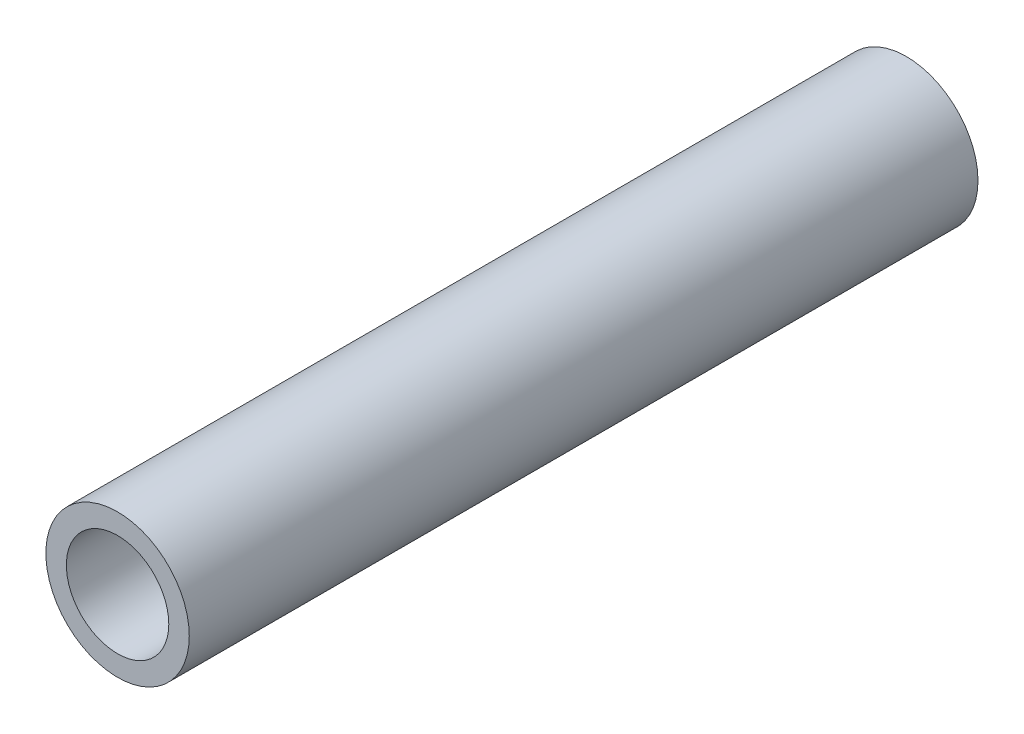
ISO-10303-21;
HEADER;
FILE_DESCRIPTION(('STEP AP214'),'2;1');
FILE_NAME('part.step','',(''),(''),'','','');
FILE_SCHEMA(('AUTOMOTIVE_DESIGN { 1 0 10303 214 1 1 1 1 }'));
ENDSEC;
DATA;
#1=APPLICATION_CONTEXT('core data for automotive mechanical design processes');
#2=APPLICATION_PROTOCOL_DEFINITION('international standard','automotive_design',2000,#1);
#3=PRODUCT_CONTEXT('',#1,'mechanical');
#4=PRODUCT('Part','Part','',(#3));
#5=PRODUCT_RELATED_PRODUCT_CATEGORY('part','',(#4));
#6=PRODUCT_DEFINITION_FORMATION('','',#4);
#7=PRODUCT_DEFINITION_CONTEXT('part definition',#1,'design');
#8=PRODUCT_DEFINITION('design','',#6,#7);
#9=PRODUCT_DEFINITION_SHAPE('','',#8);
#10=(LENGTH_UNIT() NAMED_UNIT(*) SI_UNIT(.MILLI.,.METRE.));
#11=(NAMED_UNIT(*) PLANE_ANGLE_UNIT() SI_UNIT($,.RADIAN.));
#12=(NAMED_UNIT(*) SI_UNIT($,.STERADIAN.) SOLID_ANGLE_UNIT());
#13=UNCERTAINTY_MEASURE_WITH_UNIT(LENGTH_MEASURE(1.E-05),#10,'distance_accuracy_value','');
#14=(GEOMETRIC_REPRESENTATION_CONTEXT(3) GLOBAL_UNCERTAINTY_ASSIGNED_CONTEXT((#13)) GLOBAL_UNIT_ASSIGNED_CONTEXT((#10,
#11,#12)) REPRESENTATION_CONTEXT('',''));
#15=CARTESIAN_POINT('',(0.,0.,0.));
#16=DIRECTION('',(0.,0.,1.));
#17=DIRECTION('',(1.,0.,0.));
#18=AXIS2_PLACEMENT_3D('',#15,#16,#17);
#19=CARTESIAN_POINT('',(0.,0.,154.));
#20=DIRECTION('',(0.,0.,1.));
#21=DIRECTION('',(1.,0.,0.));
#22=AXIS2_PLACEMENT_3D('',#19,#20,#21);
#23=PLANE('',#22);
#24=CARTESIAN_POINT('',(0.,0.,154.));
#25=DIRECTION('',(0.,0.,1.));
#26=DIRECTION('',(1.,0.,0.));
#27=AXIS2_PLACEMENT_3D('',#24,#25,#26);
#28=CIRCLE('',#27,14.);
#29=CARTESIAN_POINT('',(14.,0.,154.));
#30=VERTEX_POINT('',#29);
#31=EDGE_CURVE('E10',#30,#30,#28,.T.);
#32=ORIENTED_EDGE('',*,*,#31,.T.);
#33=EDGE_LOOP('',(#32));
#34=FACE_BOUND('',#33,.T.);
#35=CARTESIAN_POINT('',(0.,0.,154.));
#36=DIRECTION('',(0.,0.,1.));
#37=DIRECTION('',(1.,0.,0.));
#38=AXIS2_PLACEMENT_3D('',#35,#36,#37);
#39=CIRCLE('',#38,10.);
#40=CARTESIAN_POINT('',(10.,0.,154.));
#41=VERTEX_POINT('',#40);
#42=EDGE_CURVE('E45',#41,#41,#39,.T.);
#43=ORIENTED_EDGE('',*,*,#42,.F.);
#44=EDGE_LOOP('',(#43));
#45=FACE_BOUND('',#44,.T.);
#46=ADVANCED_FACE('F34',(#34,#45),#23,.T.);
#47=CARTESIAN_POINT('',(0.,0.,0.));
#48=DIRECTION('',(0.,0.,1.));
#49=DIRECTION('',(1.,0.,0.));
#50=AXIS2_PLACEMENT_3D('',#47,#48,#49);
#51=PLANE('',#50);
#52=CARTESIAN_POINT('',(0.,0.,0.));
#53=DIRECTION('',(0.,0.,1.));
#54=DIRECTION('',(1.,0.,0.));
#55=AXIS2_PLACEMENT_3D('',#52,#53,#54);
#56=CIRCLE('',#55,14.);
#57=CARTESIAN_POINT('',(14.,0.,0.));
#58=VERTEX_POINT('',#57);
#59=EDGE_CURVE('E41',#58,#58,#56,.T.);
#60=ORIENTED_EDGE('',*,*,#59,.F.);
#61=EDGE_LOOP('',(#60));
#62=FACE_BOUND('',#61,.T.);
#63=CARTESIAN_POINT('',(0.,0.,0.));
#64=DIRECTION('',(0.,0.,1.));
#65=DIRECTION('',(1.,0.,0.));
#66=AXIS2_PLACEMENT_3D('',#63,#64,#65);
#67=CIRCLE('',#66,10.);
#68=CARTESIAN_POINT('',(10.,0.,0.));
#69=VERTEX_POINT('',#68);
#70=EDGE_CURVE('E49',#69,#69,#67,.T.);
#71=ORIENTED_EDGE('',*,*,#70,.T.);
#72=EDGE_LOOP('',(#71));
#73=FACE_BOUND('',#72,.T.);
#74=ADVANCED_FACE('F55',(#62,#73),#51,.F.);
#75=CARTESIAN_POINT('',(0.,0.,154.));
#76=DIRECTION('',(0.,0.,-1.));
#77=DIRECTION('',(-1.,0.,0.));
#78=AXIS2_PLACEMENT_3D('',#75,#76,#77);
#79=CYLINDRICAL_SURFACE('',#78,14.);
#80=ORIENTED_EDGE('',*,*,#31,.F.);
#81=EDGE_LOOP('',(#80));
#82=FACE_BOUND('',#81,.T.);
#83=ORIENTED_EDGE('',*,*,#59,.T.);
#84=EDGE_LOOP('',(#83));
#85=FACE_BOUND('',#84,.T.);
#86=ADVANCED_FACE('F36',(#82,#85),#79,.T.);
#87=CARTESIAN_POINT('',(0.,0.,154.));
#88=DIRECTION('',(0.,0.,-1.));
#89=DIRECTION('',(-1.,0.,0.));
#90=AXIS2_PLACEMENT_3D('',#87,#88,#89);
#91=CYLINDRICAL_SURFACE('',#90,10.);
#92=ORIENTED_EDGE('',*,*,#42,.T.);
#93=EDGE_LOOP('',(#92));
#94=FACE_BOUND('',#93,.T.);
#95=ORIENTED_EDGE('',*,*,#70,.F.);
#96=EDGE_LOOP('',(#95));
#97=FACE_BOUND('',#96,.T.);
#98=ADVANCED_FACE('F57',(#94,#97),#91,.F.);
#99=CLOSED_SHELL('',(#46,#74,#86,#98));
#100=MANIFOLD_SOLID_BREP('B2',#99);
#101=ADVANCED_BREP_SHAPE_REPRESENTATION('',(#18,#100),#14);
#102=SHAPE_DEFINITION_REPRESENTATION(#9,#101);
ENDSEC;
END-ISO-10303-21;
